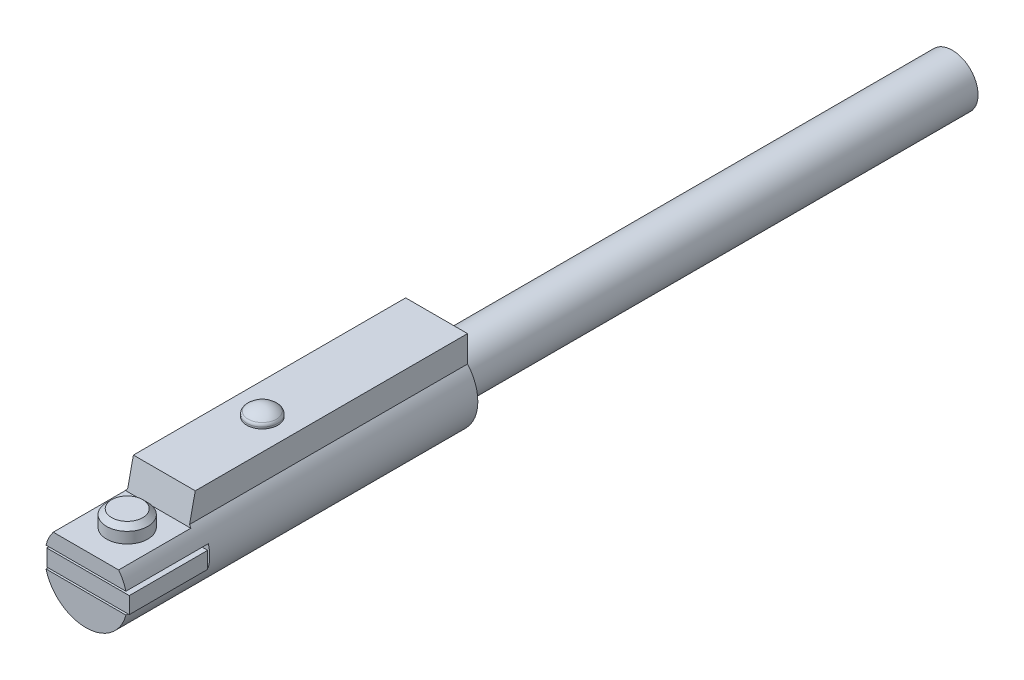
ISO-10303-21;
HEADER;
FILE_DESCRIPTION(('STEP AP214'),'2;1');
FILE_NAME('part.step','',(''),(''),'','','');
FILE_SCHEMA(('AUTOMOTIVE_DESIGN { 1 0 10303 214 1 1 1 1 }'));
ENDSEC;
DATA;
#1=APPLICATION_CONTEXT('core data for automotive mechanical design processes');
#2=APPLICATION_PROTOCOL_DEFINITION('international standard','automotive_design',2000,#1);
#3=PRODUCT_CONTEXT('',#1,'mechanical');
#4=PRODUCT('Part','Part','',(#3));
#5=PRODUCT_RELATED_PRODUCT_CATEGORY('part','',(#4));
#6=PRODUCT_DEFINITION_FORMATION('','',#4);
#7=PRODUCT_DEFINITION_CONTEXT('part definition',#1,'design');
#8=PRODUCT_DEFINITION('design','',#6,#7);
#9=PRODUCT_DEFINITION_SHAPE('','',#8);
#10=(LENGTH_UNIT() NAMED_UNIT(*) SI_UNIT(.MILLI.,.METRE.));
#11=(NAMED_UNIT(*) PLANE_ANGLE_UNIT() SI_UNIT($,.RADIAN.));
#12=(NAMED_UNIT(*) SI_UNIT($,.STERADIAN.) SOLID_ANGLE_UNIT());
#13=UNCERTAINTY_MEASURE_WITH_UNIT(LENGTH_MEASURE(1.E-05),#10,'distance_accuracy_value','');
#14=(GEOMETRIC_REPRESENTATION_CONTEXT(3) GLOBAL_UNCERTAINTY_ASSIGNED_CONTEXT((#13)) GLOBAL_UNIT_ASSIGNED_CONTEXT((#10,
#11,#12)) REPRESENTATION_CONTEXT('',''));
#15=CARTESIAN_POINT('',(0.,0.,0.));
#16=DIRECTION('',(0.,0.,1.));
#17=DIRECTION('',(1.,0.,0.));
#18=AXIS2_PLACEMENT_3D('',#15,#16,#17);
#19=CARTESIAN_POINT('',(0.,1.32,15.));
#20=DIRECTION('',(0.,-1.,0.));
#21=DIRECTION('',(0.,0.,-1.));
#22=AXIS2_PLACEMENT_3D('',#19,#20,#21);
#23=CYLINDRICAL_SURFACE('',#22,0.7835);
#24=CARTESIAN_POINT('',(0.,-1.7835,15.));
#25=DIRECTION('',(0.,-1.,0.));
#26=DIRECTION('',(0.,0.,-1.));
#27=AXIS2_PLACEMENT_3D('',#24,#25,#26);
#28=CIRCLE('',#27,0.7835);
#29=CARTESIAN_POINT('',(0.,-1.7835,14.2165));
#30=VERTEX_POINT('',#29);
#31=EDGE_CURVE('E155',#30,#30,#28,.T.);
#32=ORIENTED_EDGE('',*,*,#31,.T.);
#33=EDGE_LOOP('',(#32));
#34=FACE_BOUND('',#33,.T.);
#35=CARTESIAN_POINT('',(0.,-1.471,15.));
#36=DIRECTION('',(0.,1.,0.));
#37=DIRECTION('',(0.,0.,1.));
#38=AXIS2_PLACEMENT_3D('',#35,#36,#37);
#39=CIRCLE('',#38,0.7835);
#40=CARTESIAN_POINT('',(0.,-1.471,15.7835));
#41=VERTEX_POINT('',#40);
#42=EDGE_CURVE('E158',#41,#41,#39,.T.);
#43=ORIENTED_EDGE('',*,*,#42,.T.);
#44=EDGE_LOOP('',(#43));
#45=FACE_BOUND('',#44,.T.);
#46=ADVANCED_FACE('F16',(#34,#45),#23,.F.);
#47=CARTESIAN_POINT('',(0.,0.,17.));
#48=DIRECTION('',(0.,0.,-1.));
#49=DIRECTION('',(-1.,0.,0.));
#50=AXIS2_PLACEMENT_3D('',#47,#48,#49);
#51=CYLINDRICAL_SURFACE('',#50,2.);
#52=CARTESIAN_POINT('',(0.,0.,13.));
#53=DIRECTION('',(0.,0.,-1.));
#54=DIRECTION('',(-1.,0.,0.));
#55=AXIS2_PLACEMENT_3D('',#52,#53,#54);
#56=CIRCLE('',#55,2.);
#57=CARTESIAN_POINT('',(-1.93649167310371,-0.5,13.));
#58=VERTEX_POINT('',#57);
#59=CARTESIAN_POINT('',(-1.93649167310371,0.5,13.));
#60=VERTEX_POINT('',#59);
#61=EDGE_CURVE('E266',#58,#60,#56,.T.);
#62=ORIENTED_EDGE('',*,*,#61,.T.);
#63=DIRECTION('',(0.,0.,-1.));
#64=VECTOR('',#63,1.);
#65=CARTESIAN_POINT('',(-1.93649167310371,0.5,17.));
#66=LINE('',#65,#64);
#67=CARTESIAN_POINT('',(-1.93649167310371,0.5,17.));
#68=VERTEX_POINT('',#67);
#69=EDGE_CURVE('E194',#60,#68,#66,.F.);
#70=ORIENTED_EDGE('',*,*,#69,.T.);
#71=CARTESIAN_POINT('',(0.,0.,17.));
#72=DIRECTION('',(0.,0.,1.));
#73=DIRECTION('',(1.,0.,0.));
#74=AXIS2_PLACEMENT_3D('',#71,#72,#73);
#75=CIRCLE('',#74,2.);
#76=CARTESIAN_POINT('',(-1.58480282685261,1.22,17.));
#77=VERTEX_POINT('',#76);
#78=EDGE_CURVE('E225',#77,#68,#75,.T.);
#79=ORIENTED_EDGE('',*,*,#78,.F.);
#80=DIRECTION('',(0.,0.,-1.));
#81=VECTOR('',#80,1.);
#82=CARTESIAN_POINT('',(-1.58480282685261,1.22,17.));
#83=LINE('',#82,#81);
#84=CARTESIAN_POINT('',(-1.58480282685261,1.22,13.5));
#85=VERTEX_POINT('',#84);
#86=EDGE_CURVE('E215',#77,#85,#83,.T.);
#87=ORIENTED_EDGE('',*,*,#86,.T.);
#88=CARTESIAN_POINT('',(0.,0.,13.7652173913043));
#89=DIRECTION('',(0.,-0.212429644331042,-0.977176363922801));
#90=DIRECTION('',(0.,0.977176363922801,-0.212429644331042));
#91=AXIS2_PLACEMENT_3D('',#88,#89,#90);
#92=ELLIPSE('',#91,2.04671344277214,2.);
#93=CARTESIAN_POINT('',(-1.5,1.3228756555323,13.4776357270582));
#94=VERTEX_POINT('',#93);
#95=EDGE_CURVE('E218',#85,#94,#92,.T.);
#96=ORIENTED_EDGE('',*,*,#95,.T.);
#97=DIRECTION('',(0.,0.,-1.));
#98=VECTOR('',#97,1.);
#99=CARTESIAN_POINT('',(-1.5,1.3228756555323,17.));
#100=LINE('',#99,#98);
#101=CARTESIAN_POINT('',(-1.5,1.3228756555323,0.));
#102=VERTEX_POINT('',#101);
#103=EDGE_CURVE('E228',#94,#102,#100,.T.);
#104=ORIENTED_EDGE('',*,*,#103,.T.);
#105=CARTESIAN_POINT('',(0.,0.,0.));
#106=DIRECTION('',(0.,0.,1.));
#107=DIRECTION('',(1.,0.,0.));
#108=AXIS2_PLACEMENT_3D('',#105,#106,#107);
#109=CIRCLE('',#108,2.);
#110=CARTESIAN_POINT('',(1.5,1.3228756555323,0.));
#111=VERTEX_POINT('',#110);
#112=EDGE_CURVE('E231',#102,#111,#109,.T.);
#113=ORIENTED_EDGE('',*,*,#112,.T.);
#114=DIRECTION('',(0.,0.,-1.));
#115=VECTOR('',#114,1.);
#116=CARTESIAN_POINT('',(1.5,1.3228756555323,17.));
#117=LINE('',#116,#115);
#118=CARTESIAN_POINT('',(1.5,1.3228756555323,13.4776357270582));
#119=VERTEX_POINT('',#118);
#120=EDGE_CURVE('E248',#119,#111,#117,.T.);
#121=ORIENTED_EDGE('',*,*,#120,.F.);
#122=CARTESIAN_POINT('',(1.5848028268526,1.22,13.5));
#123=VERTEX_POINT('',#122);
#124=EDGE_CURVE('E222',#119,#123,#92,.T.);
#125=ORIENTED_EDGE('',*,*,#124,.T.);
#126=DIRECTION('',(0.,0.,-1.));
#127=VECTOR('',#126,1.);
#128=CARTESIAN_POINT('',(1.58480282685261,1.22,17.));
#129=LINE('',#128,#127);
#130=CARTESIAN_POINT('',(1.5848028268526,1.22,17.));
#131=VERTEX_POINT('',#130);
#132=EDGE_CURVE('E210',#123,#131,#129,.F.);
#133=ORIENTED_EDGE('',*,*,#132,.T.);
#134=CARTESIAN_POINT('',(1.93649167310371,0.5,17.));
#135=VERTEX_POINT('',#134);
#136=EDGE_CURVE('E230',#135,#131,#75,.T.);
#137=ORIENTED_EDGE('',*,*,#136,.F.);
#138=DIRECTION('',(0.,0.,-1.));
#139=VECTOR('',#138,1.);
#140=CARTESIAN_POINT('',(1.93649167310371,0.5,17.));
#141=LINE('',#140,#139);
#142=CARTESIAN_POINT('',(1.93649167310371,0.5,13.));
#143=VERTEX_POINT('',#142);
#144=EDGE_CURVE('E197',#135,#143,#141,.T.);
#145=ORIENTED_EDGE('',*,*,#144,.T.);
#146=CARTESIAN_POINT('',(1.93649167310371,-0.5,13.));
#147=VERTEX_POINT('',#146);
#148=EDGE_CURVE('E263',#143,#147,#56,.T.);
#149=ORIENTED_EDGE('',*,*,#148,.T.);
#150=DIRECTION('',(0.,0.,-1.));
#151=VECTOR('',#150,1.);
#152=CARTESIAN_POINT('',(1.93649167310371,-0.5,17.));
#153=LINE('',#152,#151);
#154=CARTESIAN_POINT('',(1.93649167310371,-0.5,13.1));
#155=VERTEX_POINT('',#154);
#156=EDGE_CURVE('E187',#147,#155,#153,.F.);
#157=ORIENTED_EDGE('',*,*,#156,.T.);
#158=CARTESIAN_POINT('',(1.93649167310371,-0.5,16.9));
#159=VERTEX_POINT('',#158);
#160=EDGE_CURVE('E191',#155,#159,#153,.F.);
#161=ORIENTED_EDGE('',*,*,#160,.T.);
#162=CARTESIAN_POINT('',(1.93649167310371,-0.5,17.));
#163=VERTEX_POINT('',#162);
#164=EDGE_CURVE('E37',#159,#163,#153,.F.);
#165=ORIENTED_EDGE('',*,*,#164,.T.);
#166=CARTESIAN_POINT('',(-1.93649167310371,-0.5,17.));
#167=VERTEX_POINT('',#166);
#168=EDGE_CURVE('E229',#167,#163,#75,.T.);
#169=ORIENTED_EDGE('',*,*,#168,.F.);
#170=DIRECTION('',(0.,0.,-1.));
#171=VECTOR('',#170,1.);
#172=CARTESIAN_POINT('',(-1.93649167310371,-0.5,17.));
#173=LINE('',#172,#171);
#174=CARTESIAN_POINT('',(-1.93649167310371,-0.5,16.9));
#175=VERTEX_POINT('',#174);
#176=EDGE_CURVE('E192',#167,#175,#173,.T.);
#177=ORIENTED_EDGE('',*,*,#176,.T.);
#178=CARTESIAN_POINT('',(-1.93649167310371,-0.5,13.1));
#179=VERTEX_POINT('',#178);
#180=EDGE_CURVE('E135',#175,#179,#173,.T.);
#181=ORIENTED_EDGE('',*,*,#180,.T.);
#182=EDGE_CURVE('E190',#179,#58,#173,.T.);
#183=ORIENTED_EDGE('',*,*,#182,.T.);
#184=EDGE_LOOP('',(#62,#70,#79,#87,#96,#104,#113,#121,#125,#133,#137,#145,#149,#157,#161,#165,
#169,#177,#181,#183));
#185=FACE_BOUND('',#184,.T.);
#186=CARTESIAN_POINT('',(-0.615336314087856,-1.90298744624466,14.3391312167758));
#187=CARTESIAN_POINT('',(-0.589488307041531,-1.91134468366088,14.3036433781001));
#188=CARTESIAN_POINT('',(-0.561286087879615,-1.91988588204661,14.269927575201));
#189=CARTESIAN_POINT('',(-0.500241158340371,-1.93668771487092,14.2069094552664));
#190=CARTESIAN_POINT('',(-0.467402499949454,-1.94494858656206,14.1776033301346));
#191=CARTESIAN_POINT('',(-0.399898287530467,-1.9598941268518,14.126452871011));
#192=CARTESIAN_POINT('',(-0.36554759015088,-1.96665018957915,14.1042169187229));
#193=CARTESIAN_POINT('',(-0.293484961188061,-1.97868580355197,14.0654803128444));
#194=CARTESIAN_POINT('',(-0.255774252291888,-1.98396588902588,14.0489775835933));
#195=CARTESIAN_POINT('',(-0.177517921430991,-1.99249710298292,14.0226386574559));
#196=CARTESIAN_POINT('',(-0.136953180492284,-1.99573273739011,14.0128533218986));
#197=CARTESIAN_POINT('',(-0.0545985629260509,-1.99967812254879,14.0009512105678));
#198=CARTESIAN_POINT('',(-0.0128096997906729,-2.00038990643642,13.9988282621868));
#199=CARTESIAN_POINT('',(0.0652017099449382,-1.99927011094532,14.0021917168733));
#200=CARTESIAN_POINT('',(0.101471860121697,-1.99774300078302,14.0067670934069));
#201=CARTESIAN_POINT('',(0.17269132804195,-1.99285025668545,14.0216102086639));
#202=CARTESIAN_POINT('',(0.207640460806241,-1.98948436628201,14.0318787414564));
#203=CARTESIAN_POINT('',(0.27570456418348,-1.98120546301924,14.0576249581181));
#204=CARTESIAN_POINT('',(0.308800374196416,-1.9762789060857,14.0731483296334));
#205=CARTESIAN_POINT('',(0.37229391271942,-1.96530841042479,14.1086459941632));
#206=CARTESIAN_POINT('',(0.402690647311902,-1.95926406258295,14.1286219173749));
#207=CARTESIAN_POINT('',(0.465081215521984,-1.94547591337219,14.17578427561));
#208=CARTESIAN_POINT('',(0.496562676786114,-1.93761464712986,14.2036119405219));
#209=CARTESIAN_POINT('',(0.555306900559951,-1.92160423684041,14.2633305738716));
#210=CARTESIAN_POINT('',(0.582566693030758,-1.91345489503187,14.2952243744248));
#211=CARTESIAN_POINT('',(0.638129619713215,-1.89573562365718,14.3694304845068));
#212=CARTESIAN_POINT('',(0.665422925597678,-1.88623192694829,14.4125163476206));
#213=CARTESIAN_POINT('',(0.713615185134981,-1.86853223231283,14.5023794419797));
#214=CARTESIAN_POINT('',(0.734509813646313,-1.86033712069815,14.5491591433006));
#215=CARTESIAN_POINT('',(0.772514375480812,-1.84491426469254,14.6528309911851));
#216=CARTESIAN_POINT('',(0.788549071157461,-1.83802877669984,14.7101723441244));
#217=CARTESIAN_POINT('',(0.811768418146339,-1.8278932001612,14.8269238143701));
#218=CARTESIAN_POINT('',(0.818953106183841,-1.82464309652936,14.8863339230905));
#219=CARTESIAN_POINT('',(0.824437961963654,-1.82217276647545,15.0074986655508));
#220=CARTESIAN_POINT('',(0.822456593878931,-1.82308023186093,15.0692689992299));
#221=CARTESIAN_POINT('',(0.808995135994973,-1.8290924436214,15.1915754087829));
#222=CARTESIAN_POINT('',(0.797511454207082,-1.83419877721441,15.2521110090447));
#223=CARTESIAN_POINT('',(0.765272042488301,-1.84788049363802,15.3700613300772));
#224=CARTESIAN_POINT('',(0.744541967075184,-1.85644627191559,15.4274841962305));
#225=CARTESIAN_POINT('',(0.693995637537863,-1.87592690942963,15.5377755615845));
#226=CARTESIAN_POINT('',(0.664181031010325,-1.88684134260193,15.5906448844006));
#227=CARTESIAN_POINT('',(0.601325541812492,-1.90769815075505,15.6817391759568));
#228=CARTESIAN_POINT('',(0.569646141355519,-1.91750025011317,15.7209372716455));
#229=CARTESIAN_POINT('',(0.500189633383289,-1.93677678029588,15.7935906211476));
#230=CARTESIAN_POINT('',(0.462421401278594,-1.94625166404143,15.8270540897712));
#231=CARTESIAN_POINT('',(0.389177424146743,-1.96205324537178,15.8807230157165));
#232=CARTESIAN_POINT('',(0.354720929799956,-1.96863218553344,15.90224164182));
#233=CARTESIAN_POINT('',(0.282567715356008,-1.98027439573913,15.9395238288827));
#234=CARTESIAN_POINT('',(0.244873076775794,-1.98533863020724,15.9552910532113));
#235=CARTESIAN_POINT('',(0.166797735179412,-1.99342087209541,15.980171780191));
#236=CARTESIAN_POINT('',(0.126399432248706,-1.99642367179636,15.9892358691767));
#237=CARTESIAN_POINT('',(0.0445203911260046,-1.99992296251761,15.9997805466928));
#238=CARTESIAN_POINT('',(0.00304039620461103,-2.0004211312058,16.0012662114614));
#239=CARTESIAN_POINT('',(-0.074446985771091,-1.99894435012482,15.9968296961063));
#240=CARTESIAN_POINT('',(-0.110513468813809,-1.99725916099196,15.9917755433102));
#241=CARTESIAN_POINT('',(-0.181258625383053,-1.99208527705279,15.9760558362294));
#242=CARTESIAN_POINT('',(-0.215937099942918,-1.98859632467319,15.9653894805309));
#243=CARTESIAN_POINT('',(-0.283677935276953,-1.98007917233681,15.9388343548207));
#244=CARTESIAN_POINT('',(-0.316704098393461,-1.9750264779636,15.9228621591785));
#245=CARTESIAN_POINT('',(-0.380004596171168,-1.96383084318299,15.8864926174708));
#246=CARTESIAN_POINT('',(-0.410277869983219,-1.95768748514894,15.8660935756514));
#247=CARTESIAN_POINT('',(-0.472476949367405,-1.94369267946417,15.8179564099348));
#248=CARTESIAN_POINT('',(-0.5038688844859,-1.93572599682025,15.7895640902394));
#249=CARTESIAN_POINT('',(-0.562360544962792,-1.91955023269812,15.7287259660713));
#250=CARTESIAN_POINT('',(-0.589457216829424,-1.91134098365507,15.6962773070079));
#251=CARTESIAN_POINT('',(-0.644580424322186,-1.89354831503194,15.620861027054));
#252=CARTESIAN_POINT('',(-0.671581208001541,-1.88404353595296,15.5771233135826));
#253=CARTESIAN_POINT('',(-0.719085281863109,-1.86642932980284,15.4859862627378));
#254=CARTESIAN_POINT('',(-0.739584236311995,-1.85832083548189,15.4385845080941));
#255=CARTESIAN_POINT('',(-0.776539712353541,-1.84321627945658,15.3338489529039));
#256=CARTESIAN_POINT('',(-0.791938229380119,-1.83656619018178,15.27608788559));
#257=CARTESIAN_POINT('',(-0.813809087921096,-1.82698066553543,15.158611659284));
#258=CARTESIAN_POINT('',(-0.820282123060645,-1.82404494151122,15.0988966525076));
#259=CARTESIAN_POINT('',(-0.82424799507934,-1.82225740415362,14.9774877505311));
#260=CARTESIAN_POINT('',(-0.821494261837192,-1.82351771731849,14.9157838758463));
#261=CARTESIAN_POINT('',(-0.80650583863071,-1.8301948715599,14.7937320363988));
#262=CARTESIAN_POINT('',(-0.794264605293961,-1.8356145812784,14.7333850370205));
#263=CARTESIAN_POINT('',(-0.760032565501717,-1.8500550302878,14.6142000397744));
#264=CARTESIAN_POINT('',(-0.737789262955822,-1.85916838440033,14.555445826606));
#265=CARTESIAN_POINT('',(-0.683704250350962,-1.87972934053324,14.4429946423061));
#266=CARTESIAN_POINT('',(-0.651872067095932,-1.89117462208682,14.3892927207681));
#267=CARTESIAN_POINT('',(-0.615336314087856,-1.90298744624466,14.3391312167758));
#268=B_SPLINE_CURVE_WITH_KNOTS('',3,(#186,#187,#188,#189,#190,#191,#192,#193,#194,#195,#196,
#197,#198,#199,#200,#201,#202,#203,#204,#205,#206,#207,#208,#209,#210,#211,#212,#213,#214,#215,
#216,#217,#218,#219,#220,#221,#222,#223,#224,#225,#226,#227,#228,#229,#230,#231,#232,#233,#234,
#235,#236,#237,#238,#239,#240,#241,#242,#243,#244,#245,#246,#247,#248,#249,#250,#251,#252,#253,
#254,#255,#256,#257,#258,#259,#260,#261,#262,#263,#264,#265,#266,#267),.UNSPECIFIED.,.T.,.F.,(4,
2,2,2,2,2,2,2,2,2,2,2,2,2,2,2,2,2,2,2,2,2,2,2,2,2,2,2,2,2,2,2,2,2,2,2,2,2,2,2,4),(0.,
0.133943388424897,0.267770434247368,0.391697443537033,0.515579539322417,0.640389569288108,
0.765099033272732,0.874342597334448,0.983601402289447,1.09383564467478,1.20411031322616,
1.33188925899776,1.45975769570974,1.61480531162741,1.76995750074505,1.94895539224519,
2.12795254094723,2.31248346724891,2.49708418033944,2.68117586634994,2.86523418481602,
3.01867787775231,3.17189989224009,3.29487488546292,3.41777141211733,3.54156510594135,
3.66527586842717,3.77413292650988,3.88300553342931,3.99367810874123,4.10439315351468,
4.23313995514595,4.36197787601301,4.51819098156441,4.67450803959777,4.85412534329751,
5.03372868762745,5.21816950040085,5.40273763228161,5.5922521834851,5.78157906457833),.UNSPECIFIED.);
#269=CARTESIAN_POINT('',(-0.615336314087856,-1.90298744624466,14.3391312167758));
#270=VERTEX_POINT('',#269);
#271=EDGE_CURVE('E271',#270,#270,#268,.T.);
#272=ORIENTED_EDGE('',*,*,#271,.F.);
#273=EDGE_LOOP('',(#272));
#274=FACE_BOUND('',#273,.T.);
#275=ADVANCED_FACE('F18',(#185,#274),#51,.T.);
#276=CARTESIAN_POINT('',(-4.,-0.5,17.));
#277=DIRECTION('',(0.,-1.,0.));
#278=DIRECTION('',(0.,0.,-1.));
#279=AXIS2_PLACEMENT_3D('',#276,#277,#278);
#280=PLANE('',#279);
#281=DIRECTION('',(1.,0.,0.));
#282=VECTOR('',#281,1.);
#283=CARTESIAN_POINT('',(-4.,-0.5,16.9));
#284=LINE('',#283,#282);
#285=EDGE_CURVE('E32',#175,#159,#284,.T.);
#286=ORIENTED_EDGE('',*,*,#285,.F.);
#287=ORIENTED_EDGE('',*,*,#176,.F.);
#288=DIRECTION('',(1.,0.,0.));
#289=VECTOR('',#288,1.);
#290=CARTESIAN_POINT('',(0.,-0.5,17.));
#291=LINE('',#290,#289);
#292=EDGE_CURVE('E259',#167,#163,#291,.T.);
#293=ORIENTED_EDGE('',*,*,#292,.T.);
#294=ORIENTED_EDGE('',*,*,#164,.F.);
#295=EDGE_LOOP('',(#286,#287,#293,#294));
#296=FACE_BOUND('',#295,.T.);
#297=ADVANCED_FACE('F316',(#296),#280,.F.);
#298=DIRECTION('',(-1.,0.,0.));
#299=VECTOR('',#298,1.);
#300=CARTESIAN_POINT('',(-4.,-0.5,13.1));
#301=LINE('',#300,#299);
#302=EDGE_CURVE('E267',#155,#179,#301,.T.);
#303=ORIENTED_EDGE('',*,*,#302,.F.);
#304=ORIENTED_EDGE('',*,*,#156,.F.);
#305=DIRECTION('',(1.,0.,0.));
#306=VECTOR('',#305,1.);
#307=CARTESIAN_POINT('',(-4.,-0.5,13.));
#308=LINE('',#307,#306);
#309=EDGE_CURVE('E181',#58,#147,#308,.T.);
#310=ORIENTED_EDGE('',*,*,#309,.F.);
#311=ORIENTED_EDGE('',*,*,#182,.F.);
#312=EDGE_LOOP('',(#303,#304,#310,#311));
#313=FACE_BOUND('',#312,.T.);
#314=ADVANCED_FACE('F319',(#313),#280,.F.);
#315=CARTESIAN_POINT('',(0.,0.,17.));
#316=DIRECTION('',(0.,0.,1.));
#317=DIRECTION('',(1.,0.,0.));
#318=AXIS2_PLACEMENT_3D('',#315,#316,#317);
#319=PLANE('',#318);
#320=DIRECTION('',(-1.,0.,0.));
#321=VECTOR('',#320,1.);
#322=CARTESIAN_POINT('',(0.,0.5,17.));
#323=LINE('',#322,#321);
#324=EDGE_CURVE('E261',#135,#68,#323,.T.);
#325=ORIENTED_EDGE('',*,*,#324,.F.);
#326=ORIENTED_EDGE('',*,*,#136,.T.);
#327=DIRECTION('',(1.,0.,0.));
#328=VECTOR('',#327,1.);
#329=CARTESIAN_POINT('',(0.,1.22,17.));
#330=LINE('',#329,#328);
#331=EDGE_CURVE('E250',#77,#131,#330,.T.);
#332=ORIENTED_EDGE('',*,*,#331,.F.);
#333=ORIENTED_EDGE('',*,*,#78,.T.);
#334=EDGE_LOOP('',(#325,#326,#332,#333));
#335=FACE_BOUND('',#334,.T.);
#336=ADVANCED_FACE('F345',(#335),#319,.T.);
#337=CARTESIAN_POINT('',(1.5,1.3228756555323,17.));
#338=DIRECTION('',(-1.,0.,0.));
#339=DIRECTION('',(0.,0.,1.));
#340=AXIS2_PLACEMENT_3D('',#337,#338,#339);
#341=PLANE('',#340);
#342=DIRECTION('',(0.,0.,-1.));
#343=VECTOR('',#342,1.);
#344=CARTESIAN_POINT('',(1.5,2.6,17.));
#345=LINE('',#344,#343);
#346=CARTESIAN_POINT('',(1.5,2.6,13.2));
#347=VERTEX_POINT('',#346);
#348=CARTESIAN_POINT('',(1.5,2.6,0.));
#349=VERTEX_POINT('',#348);
#350=EDGE_CURVE('E246',#347,#349,#345,.T.);
#351=ORIENTED_EDGE('',*,*,#350,.F.);
#352=DIRECTION('',(0.,-0.977176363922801,0.212429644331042));
#353=VECTOR('',#352,1.);
#354=CARTESIAN_POINT('',(1.5,0.591698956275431,13.6365871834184));
#355=LINE('',#354,#353);
#356=EDGE_CURVE('E221',#347,#119,#355,.T.);
#357=ORIENTED_EDGE('',*,*,#356,.T.);
#358=ORIENTED_EDGE('',*,*,#120,.T.);
#359=DIRECTION('',(0.,1.,0.));
#360=VECTOR('',#359,1.);
#361=CARTESIAN_POINT('',(1.5,1.3228756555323,0.));
#362=LINE('',#361,#360);
#363=EDGE_CURVE('E234',#111,#349,#362,.T.);
#364=ORIENTED_EDGE('',*,*,#363,.T.);
#365=EDGE_LOOP('',(#351,#357,#358,#364));
#366=FACE_BOUND('',#365,.T.);
#367=ADVANCED_FACE('F354',(#366),#341,.F.);
#368=CARTESIAN_POINT('',(1.5,2.6,17.));
#369=DIRECTION('',(0.,-1.,0.));
#370=DIRECTION('',(0.,0.,-1.));
#371=AXIS2_PLACEMENT_3D('',#368,#369,#370);
#372=PLANE('',#371);
#373=CARTESIAN_POINT('',(0.,2.6,8.45));
#374=DIRECTION('',(0.,-1.,0.));
#375=DIRECTION('',(0.,0.,-1.));
#376=AXIS2_PLACEMENT_3D('',#373,#374,#375);
#377=CIRCLE('',#376,0.749999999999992);
#378=CARTESIAN_POINT('',(0.,2.6,7.70000000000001));
#379=VERTEX_POINT('',#378);
#380=EDGE_CURVE('E256',#379,#379,#377,.F.);
#381=ORIENTED_EDGE('',*,*,#380,.F.);
#382=EDGE_LOOP('',(#381));
#383=FACE_BOUND('',#382,.T.);
#384=DIRECTION('',(0.,0.,-1.));
#385=VECTOR('',#384,1.);
#386=CARTESIAN_POINT('',(-1.5,2.6,17.));
#387=LINE('',#386,#385);
#388=CARTESIAN_POINT('',(-1.5,2.6,13.2));
#389=VERTEX_POINT('',#388);
#390=CARTESIAN_POINT('',(-1.5,2.6,0.));
#391=VERTEX_POINT('',#390);
#392=EDGE_CURVE('E244',#389,#391,#387,.T.);
#393=ORIENTED_EDGE('',*,*,#392,.F.);
#394=DIRECTION('',(1.,0.,0.));
#395=VECTOR('',#394,1.);
#396=CARTESIAN_POINT('',(-2.5,2.6,13.2));
#397=LINE('',#396,#395);
#398=EDGE_CURVE('E207',#389,#347,#397,.T.);
#399=ORIENTED_EDGE('',*,*,#398,.T.);
#400=ORIENTED_EDGE('',*,*,#350,.T.);
#401=DIRECTION('',(-1.,0.,0.));
#402=VECTOR('',#401,1.);
#403=CARTESIAN_POINT('',(1.5,2.6,0.));
#404=LINE('',#403,#402);
#405=EDGE_CURVE('E237',#349,#391,#404,.T.);
#406=ORIENTED_EDGE('',*,*,#405,.T.);
#407=EDGE_LOOP('',(#393,#399,#400,#406));
#408=FACE_BOUND('',#407,.T.);
#409=ADVANCED_FACE('F351',(#383,#408),#372,.F.);
#410=CARTESIAN_POINT('',(-1.5,2.6,17.));
#411=DIRECTION('',(1.,0.,0.));
#412=DIRECTION('',(0.,1.,0.));
#413=AXIS2_PLACEMENT_3D('',#410,#411,#412);
#414=PLANE('',#413);
#415=ORIENTED_EDGE('',*,*,#103,.F.);
#416=DIRECTION('',(0.,0.977176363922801,-0.212429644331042));
#417=VECTOR('',#416,1.);
#418=CARTESIAN_POINT('',(-1.5,1.81119133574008,13.3714801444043));
#419=LINE('',#418,#417);
#420=EDGE_CURVE('E253',#94,#389,#419,.T.);
#421=ORIENTED_EDGE('',*,*,#420,.T.);
#422=ORIENTED_EDGE('',*,*,#392,.T.);
#423=DIRECTION('',(0.,-1.,0.));
#424=VECTOR('',#423,1.);
#425=CARTESIAN_POINT('',(-1.5,2.6,0.));
#426=LINE('',#425,#424);
#427=EDGE_CURVE('E240',#391,#102,#426,.T.);
#428=ORIENTED_EDGE('',*,*,#427,.T.);
#429=EDGE_LOOP('',(#415,#421,#422,#428));
#430=FACE_BOUND('',#429,.T.);
#431=ADVANCED_FACE('F343',(#430),#414,.F.);
#432=ORIENTED_EDGE('',*,*,#292,.F.);
#433=ORIENTED_EDGE('',*,*,#168,.T.);
#434=EDGE_LOOP('',(#432,#433));
#435=FACE_BOUND('',#434,.T.);
#436=ADVANCED_FACE('F340',(#435),#319,.T.);
#437=CARTESIAN_POINT('',(0.,0.,0.));
#438=DIRECTION('',(0.,0.,1.));
#439=DIRECTION('',(1.,0.,0.));
#440=AXIS2_PLACEMENT_3D('',#437,#438,#439);
#441=PLANE('',#440);
#442=CARTESIAN_POINT('',(0.,0.,0.));
#443=DIRECTION('',(0.,0.,1.));
#444=DIRECTION('',(1.,0.,0.));
#445=AXIS2_PLACEMENT_3D('',#442,#443,#444);
#446=CIRCLE('',#445,1.25);
#447=CARTESIAN_POINT('',(1.25,0.,0.));
#448=VERTEX_POINT('',#447);
#449=EDGE_CURVE('E11',#448,#448,#446,.F.);
#450=ORIENTED_EDGE('',*,*,#449,.F.);
#451=EDGE_LOOP('',(#450));
#452=FACE_BOUND('',#451,.T.);
#453=ORIENTED_EDGE('',*,*,#112,.F.);
#454=ORIENTED_EDGE('',*,*,#427,.F.);
#455=ORIENTED_EDGE('',*,*,#405,.F.);
#456=ORIENTED_EDGE('',*,*,#363,.F.);
#457=EDGE_LOOP('',(#453,#454,#455,#456));
#458=FACE_BOUND('',#457,.T.);
#459=ADVANCED_FACE('F335',(#452,#458),#441,.F.);
#460=CARTESIAN_POINT('',(-2.5,1.22,13.5));
#461=DIRECTION('',(0.,-0.212429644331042,-0.977176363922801));
#462=DIRECTION('',(0.,0.977176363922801,-0.212429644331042));
#463=AXIS2_PLACEMENT_3D('',#460,#461,#462);
#464=PLANE('',#463);
#465=ORIENTED_EDGE('',*,*,#356,.F.);
#466=ORIENTED_EDGE('',*,*,#398,.F.);
#467=ORIENTED_EDGE('',*,*,#420,.F.);
#468=ORIENTED_EDGE('',*,*,#95,.F.);
#469=DIRECTION('',(1.,0.,0.));
#470=VECTOR('',#469,1.);
#471=CARTESIAN_POINT('',(-2.5,1.22,13.5));
#472=LINE('',#471,#470);
#473=EDGE_CURVE('E206',#85,#123,#472,.T.);
#474=ORIENTED_EDGE('',*,*,#473,.T.);
#475=ORIENTED_EDGE('',*,*,#124,.F.);
#476=EDGE_LOOP('',(#465,#466,#467,#468,#474,#475));
#477=FACE_BOUND('',#476,.T.);
#478=ADVANCED_FACE('F332',(#477),#464,.F.);
#479=CARTESIAN_POINT('',(-2.5,1.22,17.));
#480=DIRECTION('',(0.,-1.,0.));
#481=DIRECTION('',(0.,0.,-1.));
#482=AXIS2_PLACEMENT_3D('',#479,#480,#481);
#483=PLANE('',#482);
#484=CARTESIAN_POINT('',(0.,1.22,15.));
#485=DIRECTION('',(0.,-1.,0.));
#486=DIRECTION('',(0.,0.,-1.));
#487=AXIS2_PLACEMENT_3D('',#484,#485,#486);
#488=CIRCLE('',#487,1.);
#489=CARTESIAN_POINT('',(0.,1.22,14.));
#490=VERTEX_POINT('',#489);
#491=EDGE_CURVE('E25',#490,#490,#488,.F.);
#492=ORIENTED_EDGE('',*,*,#491,.F.);
#493=EDGE_LOOP('',(#492));
#494=FACE_BOUND('',#493,.T.);
#495=ORIENTED_EDGE('',*,*,#331,.T.);
#496=ORIENTED_EDGE('',*,*,#132,.F.);
#497=ORIENTED_EDGE('',*,*,#473,.F.);
#498=ORIENTED_EDGE('',*,*,#86,.F.);
#499=EDGE_LOOP('',(#495,#496,#497,#498));
#500=FACE_BOUND('',#499,.T.);
#501=ADVANCED_FACE('F330',(#494,#500),#483,.F.);
#502=CARTESIAN_POINT('',(0.,2.1,8.45));
#503=DIRECTION('',(0.,1.,0.));
#504=DIRECTION('',(0.,0.,-1.));
#505=AXIS2_PLACEMENT_3D('',#502,#503,#504);
#506=SPHERICAL_SURFACE('',#505,1.);
#507=CARTESIAN_POINT('',(0.,2.8261843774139,8.45));
#508=DIRECTION('',(0.,1.,0.));
#509=DIRECTION('',(0.,0.,1.));
#510=AXIS2_PLACEMENT_3D('',#507,#508,#509);
#511=CIRCLE('',#510,0.6875);
#512=CARTESIAN_POINT('',(0.,2.8261843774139,9.1375));
#513=VERTEX_POINT('',#512);
#514=EDGE_CURVE('E203',#513,#513,#511,.T.);
#515=ORIENTED_EDGE('',*,*,#514,.T.);
#516=EDGE_LOOP('',(#515));
#517=FACE_BOUND('',#516,.T.);
#518=ADVANCED_FACE('F326',(#517),#506,.T.);
#519=CARTESIAN_POINT('',(0.,2.68094750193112,8.45));
#520=DIRECTION('',(0.,1.,0.));
#521=DIRECTION('',(0.,0.,1.));
#522=AXIS2_PLACEMENT_3D('',#519,#520,#521);
#523=TOROIDAL_SURFACE('',#522,0.549999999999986,0.200000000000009);
#524=ORIENTED_EDGE('',*,*,#514,.F.);
#525=EDGE_LOOP('',(#524));
#526=FACE_BOUND('',#525,.T.);
#527=CARTESIAN_POINT('',(0.,2.68094750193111,8.45));
#528=DIRECTION('',(0.,1.,0.));
#529=DIRECTION('',(0.,0.,1.));
#530=AXIS2_PLACEMENT_3D('',#527,#528,#529);
#531=CIRCLE('',#530,0.75);
#532=CARTESIAN_POINT('',(0.,2.68094750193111,9.2));
#533=VERTEX_POINT('',#532);
#534=EDGE_CURVE('E200',#533,#533,#531,.T.);
#535=ORIENTED_EDGE('',*,*,#534,.T.);
#536=EDGE_LOOP('',(#535));
#537=FACE_BOUND('',#536,.T.);
#538=ADVANCED_FACE('F322',(#526,#537),#523,.T.);
#539=CARTESIAN_POINT('',(0.,2.6,8.45));
#540=DIRECTION('',(0.,1.,0.));
#541=DIRECTION('',(0.,0.,1.));
#542=AXIS2_PLACEMENT_3D('',#539,#540,#541);
#543=CYLINDRICAL_SURFACE('',#542,0.749999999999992);
#544=ORIENTED_EDGE('',*,*,#534,.F.);
#545=EDGE_LOOP('',(#544));
#546=FACE_BOUND('',#545,.T.);
#547=ORIENTED_EDGE('',*,*,#380,.T.);
#548=EDGE_LOOP('',(#547));
#549=FACE_BOUND('',#548,.T.);
#550=ADVANCED_FACE('F314',(#546,#549),#543,.T.);
#551=CARTESIAN_POINT('',(-4.,-0.5,13.));
#552=DIRECTION('',(0.,0.,-1.));
#553=DIRECTION('',(-1.,0.,0.));
#554=AXIS2_PLACEMENT_3D('',#551,#552,#553);
#555=PLANE('',#554);
#556=DIRECTION('',(1.,0.,0.));
#557=VECTOR('',#556,1.);
#558=CARTESIAN_POINT('',(-4.,0.5,13.));
#559=LINE('',#558,#557);
#560=EDGE_CURVE('E182',#60,#143,#559,.T.);
#561=ORIENTED_EDGE('',*,*,#560,.F.);
#562=ORIENTED_EDGE('',*,*,#61,.F.);
#563=ORIENTED_EDGE('',*,*,#309,.T.);
#564=ORIENTED_EDGE('',*,*,#148,.F.);
#565=EDGE_LOOP('',(#561,#562,#563,#564));
#566=FACE_BOUND('',#565,.T.);
#567=ADVANCED_FACE('F310',(#566),#555,.F.);
#568=CARTESIAN_POINT('',(-4.,0.5,13.));
#569=DIRECTION('',(0.,1.,0.));
#570=DIRECTION('',(0.,0.,1.));
#571=AXIS2_PLACEMENT_3D('',#568,#569,#570);
#572=PLANE('',#571);
#573=CARTESIAN_POINT('',(0.,0.5,15.));
#574=DIRECTION('',(0.,1.,0.));
#575=DIRECTION('',(0.,0.,1.));
#576=AXIS2_PLACEMENT_3D('',#573,#574,#575);
#577=CIRCLE('',#576,1.);
#578=CARTESIAN_POINT('',(0.,0.5,16.));
#579=VERTEX_POINT('',#578);
#580=EDGE_CURVE('E388',#579,#579,#577,.F.);
#581=ORIENTED_EDGE('',*,*,#580,.F.);
#582=EDGE_LOOP('',(#581));
#583=FACE_BOUND('',#582,.T.);
#584=ORIENTED_EDGE('',*,*,#324,.T.);
#585=ORIENTED_EDGE('',*,*,#69,.F.);
#586=ORIENTED_EDGE('',*,*,#560,.T.);
#587=ORIENTED_EDGE('',*,*,#144,.F.);
#588=EDGE_LOOP('',(#584,#585,#586,#587));
#589=FACE_BOUND('',#588,.T.);
#590=ADVANCED_FACE('F304',(#583,#589),#572,.F.);
#591=CARTESIAN_POINT('',(2.,-0.5,16.9));
#592=DIRECTION('',(0.,1.,0.));
#593=DIRECTION('',(0.,0.,1.));
#594=AXIS2_PLACEMENT_3D('',#591,#592,#593);
#595=PLANE('',#594);
#596=DIRECTION('',(-1.,0.,0.));
#597=VECTOR('',#596,1.);
#598=CARTESIAN_POINT('',(2.,-0.5,16.9));
#599=LINE('',#598,#597);
#600=CARTESIAN_POINT('',(2.,-0.5,16.9));
#601=VERTEX_POINT('',#600);
#602=EDGE_CURVE('E138',#601,#159,#599,.T.);
#603=ORIENTED_EDGE('',*,*,#602,.T.);
#604=ORIENTED_EDGE('',*,*,#160,.F.);
#605=DIRECTION('',(-1.,0.,0.));
#606=VECTOR('',#605,1.);
#607=CARTESIAN_POINT('',(2.,-0.5,13.1));
#608=LINE('',#607,#606);
#609=CARTESIAN_POINT('',(2.,-0.5,13.1));
#610=VERTEX_POINT('',#609);
#611=EDGE_CURVE('E139',#610,#155,#608,.T.);
#612=ORIENTED_EDGE('',*,*,#611,.F.);
#613=DIRECTION('',(0.,0.,-1.));
#614=VECTOR('',#613,1.);
#615=CARTESIAN_POINT('',(2.,-0.5,16.9));
#616=LINE('',#615,#614);
#617=EDGE_CURVE('E168',#601,#610,#616,.T.);
#618=ORIENTED_EDGE('',*,*,#617,.F.);
#619=EDGE_LOOP('',(#603,#604,#612,#618));
#620=FACE_BOUND('',#619,.T.);
#621=ADVANCED_FACE('F301',(#620),#595,.F.);
#622=CARTESIAN_POINT('',(-2.,-0.5,13.1));
#623=VERTEX_POINT('',#622);
#624=EDGE_CURVE('E177',#179,#623,#608,.T.);
#625=ORIENTED_EDGE('',*,*,#624,.F.);
#626=ORIENTED_EDGE('',*,*,#180,.F.);
#627=CARTESIAN_POINT('',(-2.,-0.5,16.9));
#628=VERTEX_POINT('',#627);
#629=EDGE_CURVE('E130',#175,#628,#599,.T.);
#630=ORIENTED_EDGE('',*,*,#629,.T.);
#631=DIRECTION('',(0.,0.,-1.));
#632=VECTOR('',#631,1.);
#633=CARTESIAN_POINT('',(-2.,-0.5,16.9));
#634=LINE('',#633,#632);
#635=EDGE_CURVE('E134',#628,#623,#634,.T.);
#636=ORIENTED_EDGE('',*,*,#635,.T.);
#637=EDGE_LOOP('',(#625,#626,#630,#636));
#638=FACE_BOUND('',#637,.T.);
#639=ADVANCED_FACE('F133',(#638),#595,.F.);
#640=CARTESIAN_POINT('',(2.,0.3,16.9));
#641=DIRECTION('',(0.,0.,-1.));
#642=DIRECTION('',(-1.,0.,0.));
#643=AXIS2_PLACEMENT_3D('',#640,#641,#642);
#644=PLANE('',#643);
#645=DIRECTION('',(-1.,0.,0.));
#646=VECTOR('',#645,1.);
#647=CARTESIAN_POINT('',(2.,0.3,16.9));
#648=LINE('',#647,#646);
#649=CARTESIAN_POINT('',(2.,0.3,16.9));
#650=VERTEX_POINT('',#649);
#651=CARTESIAN_POINT('',(-2.,0.3,16.9));
#652=VERTEX_POINT('',#651);
#653=EDGE_CURVE('E154',#650,#652,#648,.T.);
#654=ORIENTED_EDGE('',*,*,#653,.T.);
#655=DIRECTION('',(0.,-1.,0.));
#656=VECTOR('',#655,1.);
#657=CARTESIAN_POINT('',(-2.,0.3,16.9));
#658=LINE('',#657,#656);
#659=EDGE_CURVE('E146',#652,#628,#658,.T.);
#660=ORIENTED_EDGE('',*,*,#659,.T.);
#661=ORIENTED_EDGE('',*,*,#629,.F.);
#662=ORIENTED_EDGE('',*,*,#285,.T.);
#663=ORIENTED_EDGE('',*,*,#602,.F.);
#664=DIRECTION('',(0.,-1.,0.));
#665=VECTOR('',#664,1.);
#666=CARTESIAN_POINT('',(2.,0.3,16.9));
#667=LINE('',#666,#665);
#668=EDGE_CURVE('E165',#650,#601,#667,.T.);
#669=ORIENTED_EDGE('',*,*,#668,.F.);
#670=EDGE_LOOP('',(#654,#660,#661,#662,#663,#669));
#671=FACE_BOUND('',#670,.T.);
#672=ADVANCED_FACE('F151',(#671),#644,.F.);
#673=CARTESIAN_POINT('',(2.,-0.5,13.1));
#674=DIRECTION('',(0.,0.,1.));
#675=DIRECTION('',(1.,0.,0.));
#676=AXIS2_PLACEMENT_3D('',#673,#674,#675);
#677=PLANE('',#676);
#678=ORIENTED_EDGE('',*,*,#611,.T.);
#679=ORIENTED_EDGE('',*,*,#302,.T.);
#680=ORIENTED_EDGE('',*,*,#624,.T.);
#681=DIRECTION('',(0.,1.,0.));
#682=VECTOR('',#681,1.);
#683=CARTESIAN_POINT('',(-2.,-0.5,13.1));
#684=LINE('',#683,#682);
#685=CARTESIAN_POINT('',(-2.,0.3,13.1));
#686=VERTEX_POINT('',#685);
#687=EDGE_CURVE('E149',#623,#686,#684,.T.);
#688=ORIENTED_EDGE('',*,*,#687,.T.);
#689=DIRECTION('',(-1.,0.,0.));
#690=VECTOR('',#689,1.);
#691=CARTESIAN_POINT('',(2.,0.3,13.1));
#692=LINE('',#691,#690);
#693=CARTESIAN_POINT('',(2.,0.3,13.1));
#694=VERTEX_POINT('',#693);
#695=EDGE_CURVE('E175',#694,#686,#692,.T.);
#696=ORIENTED_EDGE('',*,*,#695,.F.);
#697=DIRECTION('',(0.,1.,0.));
#698=VECTOR('',#697,1.);
#699=CARTESIAN_POINT('',(2.,-0.5,13.1));
#700=LINE('',#699,#698);
#701=EDGE_CURVE('E170',#610,#694,#700,.T.);
#702=ORIENTED_EDGE('',*,*,#701,.F.);
#703=EDGE_LOOP('',(#678,#679,#680,#688,#696,#702));
#704=FACE_BOUND('',#703,.T.);
#705=ADVANCED_FACE('F296',(#704),#677,.F.);
#706=CARTESIAN_POINT('',(2.,0.3,13.1));
#707=DIRECTION('',(0.,-1.,0.));
#708=DIRECTION('',(0.,0.,-1.));
#709=AXIS2_PLACEMENT_3D('',#706,#707,#708);
#710=PLANE('',#709);
#711=CARTESIAN_POINT('',(0.,0.3,15.));
#712=DIRECTION('',(0.,-1.,0.));
#713=DIRECTION('',(0.,0.,-1.));
#714=AXIS2_PLACEMENT_3D('',#711,#712,#713);
#715=CIRCLE('',#714,1.);
#716=CARTESIAN_POINT('',(0.,0.3,14.));
#717=VERTEX_POINT('',#716);
#718=EDGE_CURVE('E278',#717,#717,#715,.F.);
#719=ORIENTED_EDGE('',*,*,#718,.F.);
#720=EDGE_LOOP('',(#719));
#721=FACE_BOUND('',#720,.T.);
#722=ORIENTED_EDGE('',*,*,#695,.T.);
#723=DIRECTION('',(0.,0.,1.));
#724=VECTOR('',#723,1.);
#725=CARTESIAN_POINT('',(-2.,0.3,13.1));
#726=LINE('',#725,#724);
#727=EDGE_CURVE('E163',#686,#652,#726,.T.);
#728=ORIENTED_EDGE('',*,*,#727,.T.);
#729=ORIENTED_EDGE('',*,*,#653,.F.);
#730=DIRECTION('',(0.,0.,1.));
#731=VECTOR('',#730,1.);
#732=CARTESIAN_POINT('',(2.,0.3,13.1));
#733=LINE('',#732,#731);
#734=EDGE_CURVE('E172',#694,#650,#733,.T.);
#735=ORIENTED_EDGE('',*,*,#734,.F.);
#736=EDGE_LOOP('',(#722,#728,#729,#735));
#737=FACE_BOUND('',#736,.T.);
#738=ADVANCED_FACE('F292',(#721,#737),#710,.F.);
#739=CARTESIAN_POINT('',(2.,0.,0.));
#740=DIRECTION('',(1.,0.,0.));
#741=DIRECTION('',(0.,0.,-1.));
#742=AXIS2_PLACEMENT_3D('',#739,#740,#741);
#743=PLANE('',#742);
#744=ORIENTED_EDGE('',*,*,#668,.T.);
#745=ORIENTED_EDGE('',*,*,#617,.T.);
#746=ORIENTED_EDGE('',*,*,#701,.T.);
#747=ORIENTED_EDGE('',*,*,#734,.T.);
#748=EDGE_LOOP('',(#744,#745,#746,#747));
#749=FACE_BOUND('',#748,.T.);
#750=ADVANCED_FACE('F289',(#749),#743,.T.);
#751=CARTESIAN_POINT('',(-2.,0.,0.));
#752=DIRECTION('',(1.,0.,0.));
#753=DIRECTION('',(0.,0.,-1.));
#754=AXIS2_PLACEMENT_3D('',#751,#752,#753);
#755=PLANE('',#754);
#756=ORIENTED_EDGE('',*,*,#659,.F.);
#757=ORIENTED_EDGE('',*,*,#727,.F.);
#758=ORIENTED_EDGE('',*,*,#687,.F.);
#759=ORIENTED_EDGE('',*,*,#635,.F.);
#760=EDGE_LOOP('',(#756,#757,#758,#759));
#761=FACE_BOUND('',#760,.T.);
#762=ADVANCED_FACE('F144',(#761),#755,.F.);
#763=CARTESIAN_POINT('',(0.,-1.7835,15.));
#764=DIRECTION('',(0.,-1.,0.));
#765=DIRECTION('',(0.,0.,-1.));
#766=AXIS2_PLACEMENT_3D('',#763,#764,#765);
#767=CONICAL_SURFACE('',#766,0.7835,0.785398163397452);
#768=ORIENTED_EDGE('',*,*,#31,.F.);
#769=EDGE_LOOP('',(#768));
#770=FACE_BOUND('',#769,.T.);
#771=ORIENTED_EDGE('',*,*,#271,.T.);
#772=EDGE_LOOP('',(#771));
#773=FACE_BOUND('',#772,.T.);
#774=ADVANCED_FACE('F279',(#770,#773),#767,.F.);
#775=CARTESIAN_POINT('',(0.,-1.5,15.));
#776=DIRECTION('',(0.,1.,0.));
#777=DIRECTION('',(0.,0.,1.));
#778=AXIS2_PLACEMENT_3D('',#775,#776,#777);
#779=PLANE('',#778);
#780=CARTESIAN_POINT('',(0.,-1.5,15.));
#781=DIRECTION('',(0.,-1.,0.));
#782=DIRECTION('',(0.,0.,-1.));
#783=AXIS2_PLACEMENT_3D('',#780,#781,#782);
#784=CIRCLE('',#783,0.7545);
#785=CARTESIAN_POINT('',(0.,-1.5,14.2455));
#786=VERTEX_POINT('',#785);
#787=EDGE_CURVE('E377',#786,#786,#784,.T.);
#788=ORIENTED_EDGE('',*,*,#787,.T.);
#789=EDGE_LOOP('',(#788));
#790=FACE_BOUND('',#789,.T.);
#791=ADVANCED_FACE('F284',(#790),#779,.F.);
#792=CARTESIAN_POINT('',(0.,-1.2545,15.));
#793=DIRECTION('',(0.,1.,0.));
#794=DIRECTION('',(0.,0.,1.));
#795=AXIS2_PLACEMENT_3D('',#792,#793,#794);
#796=CONICAL_SURFACE('',#795,1.,0.785398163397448);
#797=ORIENTED_EDGE('',*,*,#42,.F.);
#798=EDGE_LOOP('',(#797));
#799=FACE_BOUND('',#798,.T.);
#800=ORIENTED_EDGE('',*,*,#787,.F.);
#801=EDGE_LOOP('',(#800));
#802=FACE_BOUND('',#801,.T.);
#803=ADVANCED_FACE('F596',(#799,#802),#796,.T.);
#804=CARTESIAN_POINT('',(0.,2.,15.));
#805=DIRECTION('',(0.,-1.,0.));
#806=DIRECTION('',(0.,0.,-1.));
#807=AXIS2_PLACEMENT_3D('',#804,#805,#806);
#808=CYLINDRICAL_SURFACE('',#807,1.);
#809=ORIENTED_EDGE('',*,*,#718,.T.);
#810=EDGE_LOOP('',(#809));
#811=FACE_BOUND('',#810,.T.);
#812=ORIENTED_EDGE('',*,*,#580,.T.);
#813=EDGE_LOOP('',(#812));
#814=FACE_BOUND('',#813,.T.);
#815=ADVANCED_FACE('F605',(#811,#814),#808,.T.);
#816=CARTESIAN_POINT('',(0.,1.7545,15.));
#817=DIRECTION('',(0.,-1.,0.));
#818=DIRECTION('',(0.,0.,-1.));
#819=AXIS2_PLACEMENT_3D('',#816,#817,#818);
#820=CIRCLE('',#819,1.);
#821=CARTESIAN_POINT('',(0.,1.7545,14.));
#822=VERTEX_POINT('',#821);
#823=EDGE_CURVE('E379',#822,#822,#820,.T.);
#824=ORIENTED_EDGE('',*,*,#823,.T.);
#825=EDGE_LOOP('',(#824));
#826=FACE_BOUND('',#825,.T.);
#827=ORIENTED_EDGE('',*,*,#491,.T.);
#828=EDGE_LOOP('',(#827));
#829=FACE_BOUND('',#828,.T.);
#830=ADVANCED_FACE('F393',(#826,#829),#808,.T.);
#831=CARTESIAN_POINT('',(0.,2.,15.));
#832=DIRECTION('',(0.,-1.,0.));
#833=DIRECTION('',(0.,0.,-1.));
#834=AXIS2_PLACEMENT_3D('',#831,#832,#833);
#835=CONICAL_SURFACE('',#834,0.7545,0.785398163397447);
#836=ORIENTED_EDGE('',*,*,#823,.F.);
#837=EDGE_LOOP('',(#836));
#838=FACE_BOUND('',#837,.T.);
#839=CARTESIAN_POINT('',(0.,2.,15.));
#840=DIRECTION('',(0.,-1.,0.));
#841=DIRECTION('',(0.,0.,-1.));
#842=AXIS2_PLACEMENT_3D('',#839,#840,#841);
#843=CIRCLE('',#842,0.7545);
#844=CARTESIAN_POINT('',(0.,2.,14.2455));
#845=VERTEX_POINT('',#844);
#846=EDGE_CURVE('E384',#845,#845,#843,.T.);
#847=ORIENTED_EDGE('',*,*,#846,.T.);
#848=EDGE_LOOP('',(#847));
#849=FACE_BOUND('',#848,.T.);
#850=ADVANCED_FACE('F627',(#838,#849),#835,.T.);
#851=CARTESIAN_POINT('',(0.,2.,15.7545));
#852=DIRECTION('',(0.,-1.,0.));
#853=DIRECTION('',(0.,0.,-1.));
#854=AXIS2_PLACEMENT_3D('',#851,#852,#853);
#855=PLANE('',#854);
#856=ORIENTED_EDGE('',*,*,#846,.F.);
#857=EDGE_LOOP('',(#856));
#858=FACE_BOUND('',#857,.T.);
#859=ADVANCED_FACE('F637',(#858),#855,.F.);
#860=CARTESIAN_POINT('',(0.,0.,-25.));
#861=DIRECTION('',(0.,0.,1.));
#862=DIRECTION('',(1.,0.,0.));
#863=AXIS2_PLACEMENT_3D('',#860,#861,#862);
#864=PLANE('',#863);
#865=CARTESIAN_POINT('',(0.,0.,-25.));
#866=DIRECTION('',(0.,0.,-1.));
#867=DIRECTION('',(-1.,0.,0.));
#868=AXIS2_PLACEMENT_3D('',#865,#866,#867);
#869=CIRCLE('',#868,1.25);
#870=CARTESIAN_POINT('',(-1.25,0.,-25.));
#871=VERTEX_POINT('',#870);
#872=EDGE_CURVE('E771',#871,#871,#869,.T.);
#873=ORIENTED_EDGE('',*,*,#872,.T.);
#874=EDGE_LOOP('',(#873));
#875=FACE_BOUND('',#874,.T.);
#876=ADVANCED_FACE('F648',(#875),#864,.F.);
#877=CARTESIAN_POINT('',(0.,0.,0.));
#878=DIRECTION('',(0.,0.,-1.));
#879=DIRECTION('',(-1.,0.,0.));
#880=AXIS2_PLACEMENT_3D('',#877,#878,#879);
#881=CYLINDRICAL_SURFACE('',#880,1.25);
#882=ORIENTED_EDGE('',*,*,#872,.F.);
#883=EDGE_LOOP('',(#882));
#884=FACE_BOUND('',#883,.T.);
#885=ORIENTED_EDGE('',*,*,#449,.T.);
#886=EDGE_LOOP('',(#885));
#887=FACE_BOUND('',#886,.T.);
#888=ADVANCED_FACE('F659',(#884,#887),#881,.T.);
#889=CLOSED_SHELL('',(#46,#275,#297,#314,#336,#367,#409,#431,#436,#459,#478,#501,#518,#538,#550,
#567,#590,#621,#639,#672,#705,#738,#750,#762,#774,#791,#803,#815,#830,#850,#859,#876,#888));
#890=MANIFOLD_SOLID_BREP('B1',#889);
#891=ADVANCED_BREP_SHAPE_REPRESENTATION('',(#18,#890),#14);
#892=SHAPE_DEFINITION_REPRESENTATION(#9,#891);
ENDSEC;
END-ISO-10303-21;
